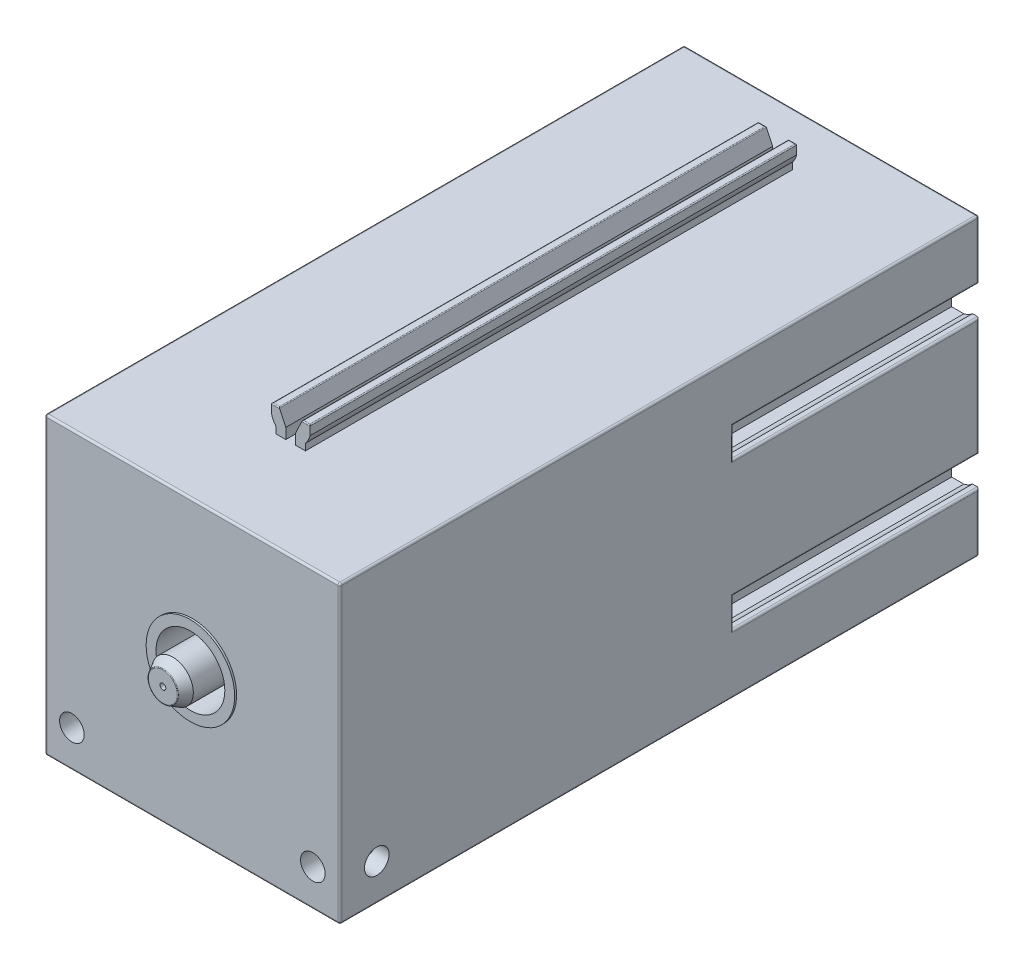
from build123d import *

# Parameters (mm, degrees)
SKETCH_1_W          = 30
SKETCH_1_H          = 30
EXTRUDE_1_DEPTH     = 65
CUT_EXTRUDE_1_DEPTH = 54
CUT_EXTRUDE_2_DEPTH = 25
EXTRUDE_START       = -5.5
EXTRUDE_2_DEPTH     = 49.5
FILLET_1_R          = 0.1
SKETCH_6_R          = 3.5
CUT_EXTRUDE_3_DEPTH = 5
EXTRUDE_START_2     = 0.2
SKETCH_7_R          = 4.5
SKETCH_7_R_2        = 3.5
EXTRUDE_3_DEPTH     = 0.2
SKETCH_8_R          = 2.1
EXTRUDE_4_DEPTH     = 8
SKETCH_9_R          = 0.3
CUT_EXTRUDE_4_DEPTH = 8
CHAMFER_1_SIZE      = 1
CHAMFER_1_SIZE2     = 0.577350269
FILLET_2_R          = 0.1
FILLET_3_R          = 0.2
SKETCH_10_R         = 1.25
CUT_EXTRUDE_5_DEPTH = 5
SKETCH_11_R         = 1.25
CUT_EXTRUDE_6_DEPTH = 5
CUT_EXTRUDE_START   = -5
SKETCH_12_R         = 1.25
CUT_EXTRUDE_7_DEPTH = 5


with BuildPart() as part:
    # Sketch 1 → Extrude 1 (new body)
    with BuildSketch(Plane.XY):
        with Locations((0, 15)):
            Rectangle(SKETCH_1_W, SKETCH_1_H)
    extrude(amount=-EXTRUDE_1_DEPTH)

    # Sketch 2 → Cut-Extrude 1 (cut)
    with BuildSketch(Plane(origin=(0, 0, -65), x_dir=(-1, 0, 0), z_dir=(0, 0, -1))):
        with BuildLine():
            Line((-9, 0.677124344), (-9, 0))
            Line((-9, 0), (-6, 0))
            Line((-6, 0), (-6, 0.677124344))
            ThreePointArc((-6, 0.677124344), (-5.719957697, 1.088161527), (-5.55, 1.555590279))
            Line((-5.55, 1.555590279), (-5.55, 2.8))
            Line((-5.55, 2.8), (-9.45, 2.8))
            Line((-9.45, 2.8), (-9.45, 1.555590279))
            ThreePointArc((-9.45, 1.555590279), (-9.280042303, 1.088161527), (-9, 0.677124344))
        make_face()
        with BuildLine():
            Line((5.55, 2.8), (5.55, 1.555590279))
            ThreePointArc((5.55, 1.555590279), (5.719957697, 1.088161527), (6, 0.677124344))
            Line((6, 0.677124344), (6, 0))
            Line((6, 0), (9, 0))
            Line((9, 0), (9, 0.677124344))
            ThreePointArc((9, 0.677124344), (9.280042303, 1.088161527), (9.45, 1.555590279))
            Line((9.45, 1.555590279), (9.45, 2.8))
            Line((9.45, 2.8), (5.55, 2.8))
        make_face()
    extrude(amount=-CUT_EXTRUDE_1_DEPTH, mode=Mode.SUBTRACT)

    # Sketch 3 → Cut-Extrude 2 (cut)
    with BuildSketch(Plane(origin=(0, 0, -65), x_dir=(-1, 0, 0), z_dir=(0, 0, -1))):
        with BuildLine():
            Line((-14.322875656, 9), (-15, 9))
            Line((-15, 9), (-15, 6))
            Line((-15, 6), (-14.322875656, 6))
            ThreePointArc((-14.322875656, 6), (-13.911838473, 5.719957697), (-13.444409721, 5.55))
            Line((-13.444409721, 5.55), (-12.2, 5.55))
            Line((-12.2, 5.55), (-12.2, 9.45))
            Line((-12.2, 9.45), (-13.444409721, 9.45))
            ThreePointArc((-13.444409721, 9.45), (-13.911838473, 9.280042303), (-14.322875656, 9))
        make_face()
        with BuildLine():
            Line((-12.2, 20.55), (-13.444409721, 20.55))
            ThreePointArc((-13.444409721, 20.55), (-13.911838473, 20.719957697), (-14.322875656, 21))
            Line((-14.322875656, 21), (-15, 21))
            Line((-15, 21), (-15, 24))
            Line((-15, 24), (-14.322875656, 24))
            ThreePointArc((-14.322875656, 24), (-13.911838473, 24.280042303), (-13.444409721, 24.45))
            Line((-13.444409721, 24.45), (-12.2, 24.45))
            Line((-12.2, 24.45), (-12.2, 20.55))
        make_face()
        with BuildLine():
            Line((14.322875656, 21), (15, 21))
            Line((15, 21), (15, 24))
            Line((15, 24), (14.322875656, 24))
            ThreePointArc((14.322875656, 24), (13.911838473, 24.280042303), (13.444409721, 24.45))
            Line((13.444409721, 24.45), (12.2, 24.45))
            Line((12.2, 24.45), (12.2, 20.55))
            Line((12.2, 20.55), (13.444409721, 20.55))
            ThreePointArc((13.444409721, 20.55), (13.911838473, 20.719957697), (14.322875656, 21))
        make_face()
        with BuildLine():
            Line((12.2, 9.45), (13.444409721, 9.45))
            ThreePointArc((13.444409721, 9.45), (13.911838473, 9.280042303), (14.322875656, 9))
            Line((14.322875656, 9), (15, 9))
            Line((15, 9), (15, 6))
            Line((15, 6), (14.322875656, 6))
            ThreePointArc((14.322875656, 6), (13.911838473, 5.719957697), (13.444409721, 5.55))
            Line((13.444409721, 5.55), (12.2, 5.55))
            Line((12.2, 5.55), (12.2, 9.45))
        make_face()
    extrude(amount=-CUT_EXTRUDE_2_DEPTH, mode=Mode.SUBTRACT)

    # Sketch 5 → Extrude 2 (add)
    with BuildSketch(Plane(origin=(0, 0, -65), x_dir=(-1, 0, 0), z_dir=(0, 0, -1)).offset(EXTRUDE_START)):
        with BuildLine():
            Line((-1.5, 30.677124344), (-1.5, 30))
            Line((-1.5, 30), (-0.5, 30))
            Line((-0.5, 30), (-0.5, 31.07225346))
            Line((-0.5, 31.07225346), (-1.165769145, 32.5))
            Line((-1.165769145, 32.5), (-1.95, 32.5))
            Line((-1.95, 32.5), (-1.95, 31.555590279))
            ThreePointArc((-1.95, 31.555590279), (-1.780042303, 31.088161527), (-1.5, 30.677124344))
        make_face()
        with BuildLine():
            Line((1.5, 30), (1.5, 30.677124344))
            ThreePointArc((1.5, 30.677124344), (1.780042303, 31.088161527), (1.95, 31.555590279))
            Line((1.95, 31.555590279), (1.95, 32.5))
            Line((1.95, 32.5), (1.165769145, 32.5))
            Line((1.165769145, 32.5), (0.5, 31.07225346))
            Line((0.5, 31.07225346), (0.5, 30))
            Line((0.5, 30), (1.5, 30))
        make_face()
    extrude(amount=-EXTRUDE_2_DEPTH)

    # Fillet 1
    fillet_1_edges = [part.edges().sort_by_distance(p)[0] for p in [
        (1.557884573, 32.5, -10),
        (1.95, 32.5, -34.75),
        (1.165769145, 32.5, -34.75),
        (1.557884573, 32.5, -59.5),
        (-1.557884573, 32.5, -10),
        (-1.165769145, 32.5, -34.75),
        (-1.95, 32.5, -34.75),
        (-1.557884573, 32.5, -59.5),
    ]]
    fillet(fillet_1_edges, radius=FILLET_1_R)

    # Sketch 6 → Cut-Extrude 3 (cut)
    with BuildSketch(Plane.XY):
        with Locations((0, 15)):
            Circle(SKETCH_6_R)
    extrude(amount=-CUT_EXTRUDE_3_DEPTH, mode=Mode.SUBTRACT)

    # Sketch 7 → Extrude 3 (add)
    with BuildSketch(Plane.XY.offset(EXTRUDE_START_2)):
        with Locations(Location((0, 15, 0), (0, 0, 180))):
            Circle(SKETCH_7_R)
        with Locations((0, 15)):
            Circle(SKETCH_7_R_2, mode=Mode.SUBTRACT)
    extrude(amount=-EXTRUDE_3_DEPTH)

    # Sketch 8 → Extrude 4 (add)
    with BuildSketch(Plane.XY.offset(-5)):
        with Locations((0, 15)):
            Circle(SKETCH_8_R)
    extrude(amount=EXTRUDE_4_DEPTH)

    # Sketch 9 → Cut-Extrude 4 (cut)
    with BuildSketch(Plane.XY.offset(3)):
        with Locations((0, 15)):
            Circle(SKETCH_9_R)
    extrude(amount=-CUT_EXTRUDE_4_DEPTH, mode=Mode.SUBTRACT)

    # Chamfer 1
    chamfer_1_edges = [part.edges().sort_by_distance(p)[0] for p in [
        (-2.1, 15, 3),
    ]]
    chamfer_1_side = [part.faces().sort_by_distance(p)[0] for p in [
        (-2.1, 15, -1),
    ]]
    chamfer(chamfer_1_edges, length=CHAMFER_1_SIZE, length2=CHAMFER_1_SIZE2, reference=chamfer_1_side[0])

    # Fillet 2
    fillet_2_edges = [part.edges().sort_by_distance(p)[0] for p in [
        (-1.522649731, 15, 3),
    ]]
    fillet(fillet_2_edges, radius=FILLET_2_R)

    # Fillet 3
    fillet_3_edges = [part.edges().sort_by_distance(p)[0] for p in [
        (15, 3, -65),
        (-15, 15, -65),
        (-15, 22.5, -40),
        (-15, 24, -52.5),
        (-15, 21, -52.5),
        (-15, 3, -65),
        (0, 30, -65),
        (-15, 7.5, -40),
        (-15, 9, -52.5),
        (-15, 6, -52.5),
        (12, 0, -65),
        (7.5, 0, -11),
        (6, 0, -38),
        (9, 0, -38),
        (0, 0, -65),
        (-15, 27, -65),
        (-7.5, 0, -11),
        (-9, 0, -38),
        (-6, 0, -38),
        (0, 30, 0),
        (15, 15, 0),
        (0, 0, 0),
        (-15, 15, 0),
        (15, 15, -65),
        (-12, 0, -65),
        (15, 7.5, -40),
        (15, 6, -52.5),
        (15, 9, -52.5),
        (-15, 30, -32.5),
        (15, 30, -32.5),
        (15, 0, -32.5),
        (-15, 0, -32.5),
        (15, 27, -65),
        (15, 22.5, -40),
        (15, 21, -52.5),
        (15, 24, -52.5),
    ]]
    fillet(fillet_3_edges, radius=FILLET_3_R)

    # Sketch 10 → Cut-Extrude 5 (cut)
    with BuildSketch(Plane.XY):
        with Locations((-12.25, 3.75)):
            Circle(SKETCH_10_R)
        with Locations((12.25, 3.75)):
            Circle(SKETCH_10_R)
    extrude(amount=-CUT_EXTRUDE_5_DEPTH, mode=Mode.SUBTRACT)

    # Sketch 11 → Cut-Extrude 6 (cut)
    with BuildSketch(Plane(origin=(15, 0, 0), x_dir=(0, 0, -1), z_dir=(1, 0, 0))):
        with Locations((3.75, 3.75)):
            Circle(SKETCH_11_R)
    extrude(amount=-CUT_EXTRUDE_6_DEPTH, mode=Mode.SUBTRACT)

    # Sketch 12 → Cut-Extrude 7 (cut)
    with BuildSketch(Plane.ZY.offset(15).offset(CUT_EXTRUDE_START)):
        with Locations(Location((-3.75, 3.75, 0), (0, 0, 180))):
            Circle(SKETCH_12_R)
    extrude(amount=CUT_EXTRUDE_7_DEPTH, mode=Mode.SUBTRACT)


solid = part.part
